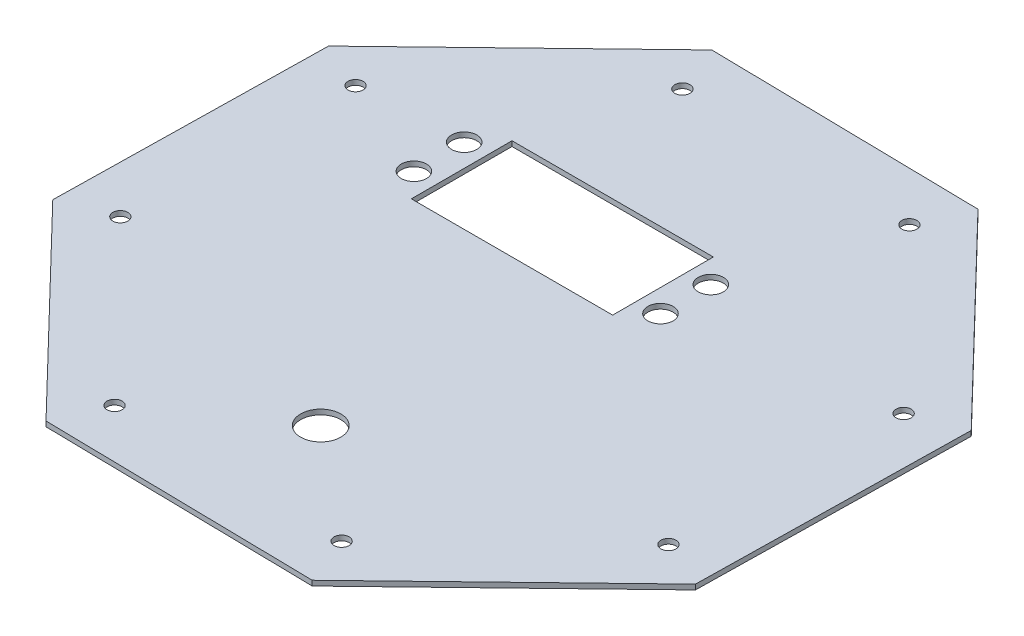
from build123d import *

# Parameters (mm, degrees)
SKETCH1_R           = 1.5
BOSS_EXTRUDE1_DEPTH = 1
SKETCH2_R           = 4
SKETCH2_R_2         = 2.5
SKETCH2_W           = 40
SKETCH2_H           = 20
CUT_EXTRUDE1_DEPTH  = 10


with BuildPart() as part:
    # Sketch1 → Boss-Extrude1 (new body)
    with BuildSketch(Plane(origin=(0, 0, 0), x_dir=(1, 0, 0), z_dir=(0, 1, 0))):
        Polygon((25.770217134, -65.465955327), (64.513716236, -28.069125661), (65.465955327, 25.770217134), (28.069125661, 64.513716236), (-25.770217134, 65.465955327), (-64.513716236, 28.069125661), (-65.465955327, -25.770217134), (-28.069125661, -64.513716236), align=None)
        with Locations(Location((-55.830144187, -21.977147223, 0), (0, 0, 270))):
            Circle(SKETCH1_R, mode=Mode.SUBTRACT)
        with Locations(Location((-55.018063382, 23.937683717, 0), (0, 0, 270))):
            Circle(SKETCH1_R, mode=Mode.SUBTRACT)
        with Locations(Location((-21.977147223, 55.830144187, 0), (0, 0, 270))):
            Circle(SKETCH1_R, mode=Mode.SUBTRACT)
        with Locations(Location((23.937683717, 55.018063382, 0), (0, 0, 270))):
            Circle(SKETCH1_R, mode=Mode.SUBTRACT)
        with Locations(Location((55.830144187, 21.977147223, 0), (0, 0, 270))):
            Circle(SKETCH1_R, mode=Mode.SUBTRACT)
        with Locations(Location((55.018063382, -23.937683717, 0), (0, 0, 270))):
            Circle(SKETCH1_R, mode=Mode.SUBTRACT)
        with Locations(Location((21.977147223, -55.830144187, 0), (0, 0, 270))):
            Circle(SKETCH1_R, mode=Mode.SUBTRACT)
        with Locations(Location((-23.937683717, -55.018063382, 0), (0, 0, 270))):
            Circle(SKETCH1_R, mode=Mode.SUBTRACT)
    extrude(amount=BOSS_EXTRUDE1_DEPTH)

    # Sketch2 → Cut-Extrude1 (cut)
    with BuildSketch(Plane(origin=(0, 1, 0), x_dir=(1, 0, 0), z_dir=(0, 1, 0))):
        with Locations(Location((0, -38, 0), (0, 0, 270))):
            Circle(SKETCH2_R)
        with Locations(Location((14.5, 15, 0), (0, 0, 270))):
            Circle(SKETCH2_R_2)
        with Locations(Location((14.5, 25, 0), (0, 0, 270))):
            Circle(SKETCH2_R_2)
        with Locations(Location((-34.5, 15, 0), (0, 0, 270))):
            Circle(SKETCH2_R_2)
        with Locations(Location((-34.5, 25, 0), (0, 0, 270))):
            Circle(SKETCH2_R_2)
        with Locations((-10, 20)):
            Rectangle(SKETCH2_W, SKETCH2_H)
    extrude(amount=-CUT_EXTRUDE1_DEPTH, mode=Mode.SUBTRACT)


solid = part.part
